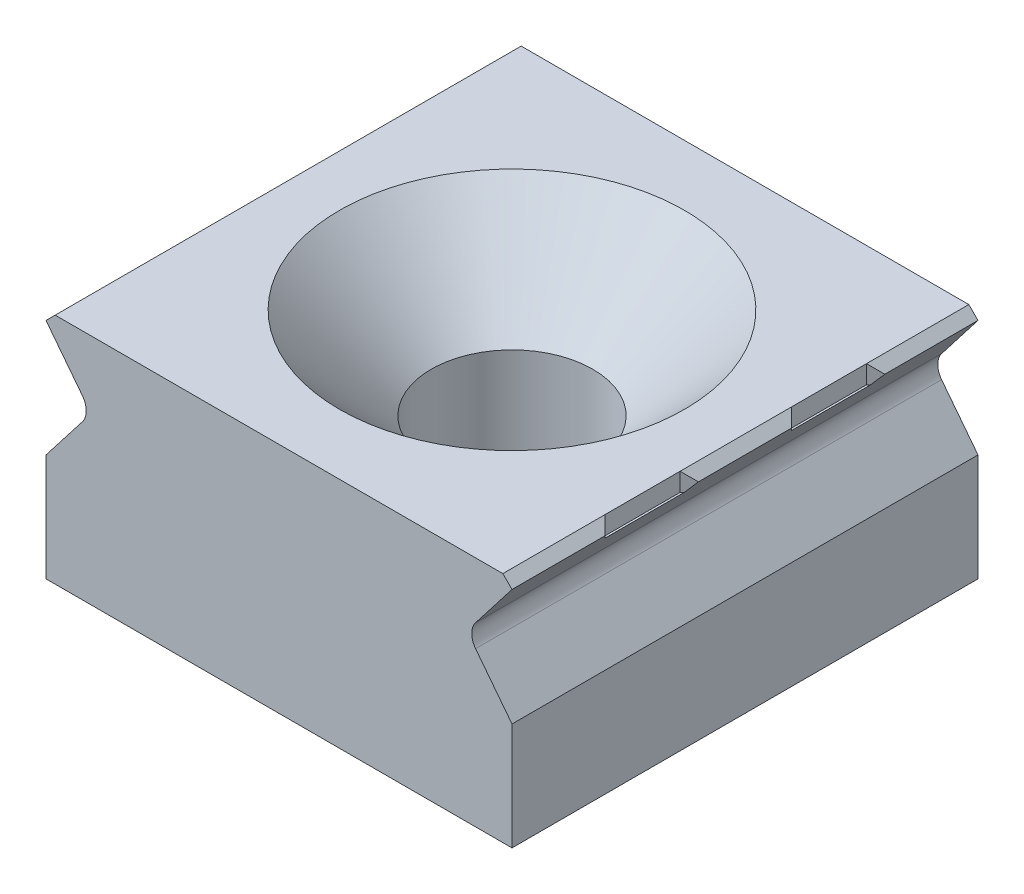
ISO-10303-21;
HEADER;
FILE_DESCRIPTION(('STEP AP214'),'2;1');
FILE_NAME('part.step','',(''),(''),'','','');
FILE_SCHEMA(('AUTOMOTIVE_DESIGN { 1 0 10303 214 1 1 1 1 }'));
ENDSEC;
DATA;
#1=APPLICATION_CONTEXT('core data for automotive mechanical design processes');
#2=APPLICATION_PROTOCOL_DEFINITION('international standard','automotive_design',2000,#1);
#3=PRODUCT_CONTEXT('',#1,'mechanical');
#4=PRODUCT('Part','Part','',(#3));
#5=PRODUCT_RELATED_PRODUCT_CATEGORY('part','',(#4));
#6=PRODUCT_DEFINITION_FORMATION('','',#4);
#7=PRODUCT_DEFINITION_CONTEXT('part definition',#1,'design');
#8=PRODUCT_DEFINITION('design','',#6,#7);
#9=PRODUCT_DEFINITION_SHAPE('','',#8);
#10=(LENGTH_UNIT() NAMED_UNIT(*) SI_UNIT(.MILLI.,.METRE.));
#11=(NAMED_UNIT(*) PLANE_ANGLE_UNIT() SI_UNIT($,.RADIAN.));
#12=(NAMED_UNIT(*) SI_UNIT($,.STERADIAN.) SOLID_ANGLE_UNIT());
#13=UNCERTAINTY_MEASURE_WITH_UNIT(LENGTH_MEASURE(1.E-05),#10,'distance_accuracy_value','');
#14=(GEOMETRIC_REPRESENTATION_CONTEXT(3) GLOBAL_UNCERTAINTY_ASSIGNED_CONTEXT((#13)) GLOBAL_UNIT_ASSIGNED_CONTEXT((#10,
#11,#12)) REPRESENTATION_CONTEXT('',''));
#15=CARTESIAN_POINT('',(0.,0.,0.));
#16=DIRECTION('',(0.,0.,1.));
#17=DIRECTION('',(1.,0.,0.));
#18=AXIS2_PLACEMENT_3D('',#15,#16,#17);
#19=CARTESIAN_POINT('',(12.2,6.35,0.));
#20=DIRECTION('',(0.707106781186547,0.707106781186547,0.));
#21=DIRECTION('',(0.,0.,1.));
#22=AXIS2_PLACEMENT_3D('',#19,#20,#21);
#23=PLANE('',#22);
#24=DIRECTION('',(0.577350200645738,-0.577350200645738,0.577350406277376));
#25=VECTOR('',#24,1.);
#26=CARTESIAN_POINT('',(13.2133335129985,5.33666648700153,-2.02666630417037));
#27=LINE('',#26,#25);
#28=CARTESIAN_POINT('',(12.2,6.35,-3.04000017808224));
#29=VERTEX_POINT('',#28);
#30=CARTESIAN_POINT('',(12.7,5.85,-2.54));
#31=VERTEX_POINT('',#30);
#32=EDGE_CURVE('E283',#29,#31,#27,.T.);
#33=ORIENTED_EDGE('',*,*,#32,.F.);
#34=DIRECTION('',(0.,0.,-1.));
#35=VECTOR('',#34,1.);
#36=CARTESIAN_POINT('',(12.2,6.35,-12.7));
#37=LINE('',#36,#35);
#38=CARTESIAN_POINT('',(12.2,6.35,3.03999982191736));
#39=VERTEX_POINT('',#38);
#40=EDGE_CURVE('E455',#39,#29,#37,.T.);
#41=ORIENTED_EDGE('',*,*,#40,.F.);
#42=DIRECTION('',(-0.577350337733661,0.577350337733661,0.577350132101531));
#43=VECTOR('',#42,1.);
#44=CARTESIAN_POINT('',(13.2133331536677,5.33666684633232,2.02666702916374));
#45=LINE('',#44,#43);
#46=CARTESIAN_POINT('',(12.7,5.85,2.53999999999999));
#47=VERTEX_POINT('',#46);
#48=EDGE_CURVE('E312',#47,#39,#45,.T.);
#49=ORIENTED_EDGE('',*,*,#48,.F.);
#50=DIRECTION('',(0.,0.,1.));
#51=VECTOR('',#50,1.);
#52=CARTESIAN_POINT('',(12.7,5.85,12.7));
#53=LINE('',#52,#51);
#54=EDGE_CURVE('E468',#31,#47,#53,.T.);
#55=ORIENTED_EDGE('',*,*,#54,.F.);
#56=EDGE_LOOP('',(#33,#41,#49,#55));
#57=FACE_BOUND('',#56,.T.);
#58=ADVANCED_FACE('F38',(#57),#23,.T.);
#59=CARTESIAN_POINT('',(-12.2,6.35,0.));
#60=DIRECTION('',(-0.707106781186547,0.707106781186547,0.));
#61=DIRECTION('',(0.,0.,-1.));
#62=AXIS2_PLACEMENT_3D('',#59,#60,#61);
#63=PLANE('',#62);
#64=DIRECTION('',(0.577350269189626,0.577350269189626,-0.577350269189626));
#65=VECTOR('',#64,1.);
#66=CARTESIAN_POINT('',(-13.2133333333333,5.33666666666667,-2.02666666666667));
#67=LINE('',#66,#65);
#68=CARTESIAN_POINT('',(-12.7,5.84999999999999,-2.53999999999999));
#69=VERTEX_POINT('',#68);
#70=CARTESIAN_POINT('',(-12.2,6.35,-3.04));
#71=VERTEX_POINT('',#70);
#72=EDGE_CURVE('E240',#69,#71,#67,.T.);
#73=ORIENTED_EDGE('',*,*,#72,.F.);
#74=DIRECTION('',(0.,0.,-1.));
#75=VECTOR('',#74,1.);
#76=CARTESIAN_POINT('',(-12.7,5.85,-12.7));
#77=LINE('',#76,#75);
#78=CARTESIAN_POINT('',(-12.7,5.84999999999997,2.54000000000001));
#79=VERTEX_POINT('',#78);
#80=EDGE_CURVE('E481',#79,#69,#77,.T.);
#81=ORIENTED_EDGE('',*,*,#80,.F.);
#82=DIRECTION('',(-0.577350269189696,-0.577350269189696,-0.577350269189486));
#83=VECTOR('',#82,1.);
#84=CARTESIAN_POINT('',(-13.2133333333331,5.33666666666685,2.02666666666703));
#85=LINE('',#84,#83);
#86=CARTESIAN_POINT('',(-12.2,6.35,3.03999999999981));
#87=VERTEX_POINT('',#86);
#88=EDGE_CURVE('E340',#87,#79,#85,.T.);
#89=ORIENTED_EDGE('',*,*,#88,.F.);
#90=DIRECTION('',(0.,0.,1.));
#91=VECTOR('',#90,1.);
#92=CARTESIAN_POINT('',(-12.2,6.35,12.7));
#93=LINE('',#92,#91);
#94=EDGE_CURVE('E449',#71,#87,#93,.T.);
#95=ORIENTED_EDGE('',*,*,#94,.F.);
#96=EDGE_LOOP('',(#73,#81,#89,#95));
#97=FACE_BOUND('',#96,.T.);
#98=ADVANCED_FACE('F537',(#97),#63,.T.);
#99=DIRECTION('',(0.577350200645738,-0.577350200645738,0.577350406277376));
#100=VECTOR('',#99,1.);
#101=CARTESIAN_POINT('',(9.8266664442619,8.72333355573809,4.74666542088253));
#102=LINE('',#101,#100);
#103=CARTESIAN_POINT('',(12.2,6.35,7.11999982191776));
#104=VERTEX_POINT('',#103);
#105=CARTESIAN_POINT('',(12.7,5.85,7.62000000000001));
#106=VERTEX_POINT('',#105);
#107=EDGE_CURVE('E337',#104,#106,#102,.T.);
#108=ORIENTED_EDGE('',*,*,#107,.F.);
#109=CARTESIAN_POINT('',(12.2,6.35,12.7));
#110=VERTEX_POINT('',#109);
#111=EDGE_CURVE('E450',#110,#104,#37,.T.);
#112=ORIENTED_EDGE('',*,*,#111,.F.);
#113=DIRECTION('',(-0.707106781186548,0.707106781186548,0.));
#114=VECTOR('',#113,1.);
#115=CARTESIAN_POINT('',(12.2,6.35,12.7));
#116=LINE('',#115,#114);
#117=CARTESIAN_POINT('',(12.7,5.85,12.7));
#118=VERTEX_POINT('',#117);
#119=EDGE_CURVE('E472',#118,#110,#116,.T.);
#120=ORIENTED_EDGE('',*,*,#119,.F.);
#121=EDGE_CURVE('E462',#106,#118,#53,.T.);
#122=ORIENTED_EDGE('',*,*,#121,.F.);
#123=EDGE_LOOP('',(#108,#112,#120,#122));
#124=FACE_BOUND('',#123,.T.);
#125=ADVANCED_FACE('F540',(#124),#23,.T.);
#126=DIRECTION('',(0.577350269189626,0.577350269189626,-0.577350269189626));
#127=VECTOR('',#126,1.);
#128=CARTESIAN_POINT('',(-9.82666666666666,8.72333333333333,4.74666666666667));
#129=LINE('',#128,#127);
#130=CARTESIAN_POINT('',(-12.7,5.84999999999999,7.62000000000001));
#131=VERTEX_POINT('',#130);
#132=CARTESIAN_POINT('',(-12.2,6.35,7.12));
#133=VERTEX_POINT('',#132);
#134=EDGE_CURVE('E343',#131,#133,#129,.T.);
#135=ORIENTED_EDGE('',*,*,#134,.F.);
#136=CARTESIAN_POINT('',(-12.7,5.85,12.7));
#137=VERTEX_POINT('',#136);
#138=EDGE_CURVE('E476',#137,#131,#77,.T.);
#139=ORIENTED_EDGE('',*,*,#138,.F.);
#140=DIRECTION('',(-0.707106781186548,-0.707106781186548,0.));
#141=VECTOR('',#140,1.);
#142=CARTESIAN_POINT('',(-12.2,6.35,12.7));
#143=LINE('',#142,#141);
#144=CARTESIAN_POINT('',(-12.2,6.35,12.7));
#145=VERTEX_POINT('',#144);
#146=EDGE_CURVE('E467',#145,#137,#143,.T.);
#147=ORIENTED_EDGE('',*,*,#146,.F.);
#148=EDGE_CURVE('E443',#133,#145,#93,.T.);
#149=ORIENTED_EDGE('',*,*,#148,.F.);
#150=EDGE_LOOP('',(#135,#139,#147,#149));
#151=FACE_BOUND('',#150,.T.);
#152=ADVANCED_FACE('F546',(#151),#63,.T.);
#153=CARTESIAN_POINT('',(12.7,6.35,12.7));
#154=DIRECTION('',(0.,0.,-1.));
#155=DIRECTION('',(-1.,0.,0.));
#156=AXIS2_PLACEMENT_3D('',#153,#154,#155);
#157=PLANE('',#156);
#158=DIRECTION('',(-0.612474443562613,0.790490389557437,0.));
#159=VECTOR('',#158,1.);
#160=CARTESIAN_POINT('',(10.7145471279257,2.06252555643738,12.7));
#161=LINE('',#160,#159);
#162=CARTESIAN_POINT('',(12.7,-0.500000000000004,12.7));
#163=VERTEX_POINT('',#162);
#164=CARTESIAN_POINT('',(10.7145471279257,2.06252555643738,12.7));
#165=VERTEX_POINT('',#164);
#166=EDGE_CURVE('E363',#163,#165,#161,.T.);
#167=ORIENTED_EDGE('',*,*,#166,.T.);
#168=CARTESIAN_POINT('',(11.5050375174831,2.675,12.7));
#169=DIRECTION('',(0.,0.,-1.));
#170=DIRECTION('',(1.,0.,0.));
#171=AXIS2_PLACEMENT_3D('',#168,#169,#170);
#172=CIRCLE('',#171,0.999999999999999);
#173=CARTESIAN_POINT('',(10.7145471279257,3.28747444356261,12.7));
#174=VERTEX_POINT('',#173);
#175=EDGE_CURVE('E359',#165,#174,#172,.T.);
#176=ORIENTED_EDGE('',*,*,#175,.T.);
#177=DIRECTION('',(0.612474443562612,0.790490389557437,0.));
#178=VECTOR('',#177,1.);
#179=CARTESIAN_POINT('',(12.7,5.85,12.7));
#180=LINE('',#179,#178);
#181=EDGE_CURVE('E345',#174,#118,#180,.T.);
#182=ORIENTED_EDGE('',*,*,#181,.T.);
#183=ORIENTED_EDGE('',*,*,#119,.T.);
#184=DIRECTION('',(1.,0.,0.));
#185=VECTOR('',#184,1.);
#186=CARTESIAN_POINT('',(12.7,6.35,12.7));
#187=LINE('',#186,#185);
#188=EDGE_CURVE('E408',#145,#110,#187,.T.);
#189=ORIENTED_EDGE('',*,*,#188,.F.);
#190=ORIENTED_EDGE('',*,*,#146,.T.);
#191=DIRECTION('',(-0.612474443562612,0.790490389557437,0.));
#192=VECTOR('',#191,1.);
#193=CARTESIAN_POINT('',(-12.7,5.85,12.7));
#194=LINE('',#193,#192);
#195=CARTESIAN_POINT('',(-10.7145471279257,3.28747444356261,12.7));
#196=VERTEX_POINT('',#195);
#197=EDGE_CURVE('E355',#196,#137,#194,.T.);
#198=ORIENTED_EDGE('',*,*,#197,.F.);
#199=CARTESIAN_POINT('',(-11.5050375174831,2.675,12.7));
#200=DIRECTION('',(0.,0.,1.));
#201=DIRECTION('',(-1.,0.,0.));
#202=AXIS2_PLACEMENT_3D('',#199,#200,#201);
#203=CIRCLE('',#202,0.999999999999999);
#204=CARTESIAN_POINT('',(-10.7145471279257,2.06252555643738,12.7));
#205=VERTEX_POINT('',#204);
#206=EDGE_CURVE('E396',#205,#196,#203,.T.);
#207=ORIENTED_EDGE('',*,*,#206,.F.);
#208=DIRECTION('',(0.612474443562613,0.790490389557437,0.));
#209=VECTOR('',#208,1.);
#210=CARTESIAN_POINT('',(-10.7145471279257,2.06252555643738,12.7));
#211=LINE('',#210,#209);
#212=CARTESIAN_POINT('',(-12.7,-0.500000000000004,12.7));
#213=VERTEX_POINT('',#212);
#214=EDGE_CURVE('E392',#213,#205,#211,.T.);
#215=ORIENTED_EDGE('',*,*,#214,.F.);
#216=DIRECTION('',(0.,-1.,0.));
#217=VECTOR('',#216,1.);
#218=CARTESIAN_POINT('',(-12.7,6.35,12.7));
#219=LINE('',#218,#217);
#220=CARTESIAN_POINT('',(-12.7,-6.35,12.7));
#221=VERTEX_POINT('',#220);
#222=EDGE_CURVE('E440',#213,#221,#219,.T.);
#223=ORIENTED_EDGE('',*,*,#222,.T.);
#224=DIRECTION('',(1.,0.,0.));
#225=VECTOR('',#224,1.);
#226=CARTESIAN_POINT('',(12.7,-6.35,12.7));
#227=LINE('',#226,#225);
#228=CARTESIAN_POINT('',(12.7,-6.35,12.7));
#229=VERTEX_POINT('',#228);
#230=EDGE_CURVE('E421',#221,#229,#227,.T.);
#231=ORIENTED_EDGE('',*,*,#230,.T.);
#232=DIRECTION('',(0.,-1.,0.));
#233=VECTOR('',#232,1.);
#234=CARTESIAN_POINT('',(12.7,6.35,12.7));
#235=LINE('',#234,#233);
#236=EDGE_CURVE('E437',#163,#229,#235,.T.);
#237=ORIENTED_EDGE('',*,*,#236,.F.);
#238=EDGE_LOOP('',(#167,#176,#182,#183,#189,#190,#198,#207,#215,#223,#231,#237));
#239=FACE_BOUND('',#238,.T.);
#240=ADVANCED_FACE('F605',(#239),#157,.F.);
#241=CARTESIAN_POINT('',(12.7,6.35,12.7));
#242=DIRECTION('',(-1.,0.,0.));
#243=DIRECTION('',(0.,0.,1.));
#244=AXIS2_PLACEMENT_3D('',#241,#242,#243);
#245=PLANE('',#244);
#246=DIRECTION('',(0.,0.,1.));
#247=VECTOR('',#246,1.);
#248=CARTESIAN_POINT('',(12.7,-0.500000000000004,-19.4186576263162));
#249=LINE('',#248,#247);
#250=CARTESIAN_POINT('',(12.7,-0.500000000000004,-12.7));
#251=VERTEX_POINT('',#250);
#252=EDGE_CURVE('E368',#251,#163,#249,.T.);
#253=ORIENTED_EDGE('',*,*,#252,.T.);
#254=ORIENTED_EDGE('',*,*,#236,.T.);
#255=DIRECTION('',(0.,0.,-1.));
#256=VECTOR('',#255,1.);
#257=CARTESIAN_POINT('',(12.7,-6.35,12.7));
#258=LINE('',#257,#256);
#259=CARTESIAN_POINT('',(12.7,-6.35,-12.7));
#260=VERTEX_POINT('',#259);
#261=EDGE_CURVE('E425',#229,#260,#258,.T.);
#262=ORIENTED_EDGE('',*,*,#261,.T.);
#263=DIRECTION('',(0.,-1.,0.));
#264=VECTOR('',#263,1.);
#265=CARTESIAN_POINT('',(12.7,6.35,-12.7));
#266=LINE('',#265,#264);
#267=EDGE_CURVE('E434',#251,#260,#266,.T.);
#268=ORIENTED_EDGE('',*,*,#267,.F.);
#269=EDGE_LOOP('',(#253,#254,#262,#268));
#270=FACE_BOUND('',#269,.T.);
#271=ADVANCED_FACE('F670',(#270),#245,.F.);
#272=CARTESIAN_POINT('',(12.7,6.35,-12.7));
#273=DIRECTION('',(0.,0.,1.));
#274=DIRECTION('',(1.,0.,0.));
#275=AXIS2_PLACEMENT_3D('',#272,#273,#274);
#276=PLANE('',#275);
#277=DIRECTION('',(0.612474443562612,-0.790490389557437,0.));
#278=VECTOR('',#277,1.);
#279=CARTESIAN_POINT('',(10.7145471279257,2.06252555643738,-12.7));
#280=LINE('',#279,#278);
#281=CARTESIAN_POINT('',(10.7145471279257,2.06252555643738,-12.7));
#282=VERTEX_POINT('',#281);
#283=EDGE_CURVE('E346',#282,#251,#280,.T.);
#284=ORIENTED_EDGE('',*,*,#283,.T.);
#285=ORIENTED_EDGE('',*,*,#267,.T.);
#286=DIRECTION('',(-1.,0.,0.));
#287=VECTOR('',#286,1.);
#288=CARTESIAN_POINT('',(12.7,-6.35,-12.7));
#289=LINE('',#288,#287);
#290=CARTESIAN_POINT('',(-12.7,-6.35,-12.7));
#291=VERTEX_POINT('',#290);
#292=EDGE_CURVE('E413',#260,#291,#289,.T.);
#293=ORIENTED_EDGE('',*,*,#292,.T.);
#294=DIRECTION('',(0.,-1.,0.));
#295=VECTOR('',#294,1.);
#296=CARTESIAN_POINT('',(-12.7,6.35,-12.7));
#297=LINE('',#296,#295);
#298=CARTESIAN_POINT('',(-12.7,-0.500000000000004,-12.7));
#299=VERTEX_POINT('',#298);
#300=EDGE_CURVE('E417',#299,#291,#297,.T.);
#301=ORIENTED_EDGE('',*,*,#300,.F.);
#302=DIRECTION('',(-0.612474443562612,-0.790490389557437,0.));
#303=VECTOR('',#302,1.);
#304=CARTESIAN_POINT('',(-10.7145471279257,2.06252555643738,-12.7));
#305=LINE('',#304,#303);
#306=CARTESIAN_POINT('',(-10.7145471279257,2.06252555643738,-12.7));
#307=VERTEX_POINT('',#306);
#308=EDGE_CURVE('E379',#307,#299,#305,.T.);
#309=ORIENTED_EDGE('',*,*,#308,.F.);
#310=CARTESIAN_POINT('',(-11.5050375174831,2.675,-12.7));
#311=DIRECTION('',(0.,0.,1.));
#312=DIRECTION('',(1.,0.,0.));
#313=AXIS2_PLACEMENT_3D('',#310,#311,#312);
#314=CIRCLE('',#313,0.999999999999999);
#315=CARTESIAN_POINT('',(-10.7145471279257,3.28747444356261,-12.7));
#316=VERTEX_POINT('',#315);
#317=EDGE_CURVE('E382',#316,#307,#314,.F.);
#318=ORIENTED_EDGE('',*,*,#317,.F.);
#319=DIRECTION('',(0.612474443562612,-0.790490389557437,0.));
#320=VECTOR('',#319,1.);
#321=CARTESIAN_POINT('',(-12.7,5.85,-12.7));
#322=LINE('',#321,#320);
#323=CARTESIAN_POINT('',(-12.7,5.85,-12.7));
#324=VERTEX_POINT('',#323);
#325=EDGE_CURVE('E386',#324,#316,#322,.T.);
#326=ORIENTED_EDGE('',*,*,#325,.F.);
#327=DIRECTION('',(0.707106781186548,0.707106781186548,0.));
#328=VECTOR('',#327,1.);
#329=CARTESIAN_POINT('',(-12.2,6.35,-12.7));
#330=LINE('',#329,#328);
#331=CARTESIAN_POINT('',(-12.2,6.35,-12.7));
#332=VERTEX_POINT('',#331);
#333=EDGE_CURVE('E454',#324,#332,#330,.T.);
#334=ORIENTED_EDGE('',*,*,#333,.T.);
#335=DIRECTION('',(-1.,0.,0.));
#336=VECTOR('',#335,1.);
#337=CARTESIAN_POINT('',(12.7,6.35,-12.7));
#338=LINE('',#337,#336);
#339=CARTESIAN_POINT('',(12.2,6.35,-12.7));
#340=VERTEX_POINT('',#339);
#341=EDGE_CURVE('E412',#340,#332,#338,.T.);
#342=ORIENTED_EDGE('',*,*,#341,.F.);
#343=DIRECTION('',(0.707106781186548,-0.707106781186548,0.));
#344=VECTOR('',#343,1.);
#345=CARTESIAN_POINT('',(12.2,6.35,-12.7));
#346=LINE('',#345,#344);
#347=CARTESIAN_POINT('',(12.7,5.85,-12.7));
#348=VERTEX_POINT('',#347);
#349=EDGE_CURVE('E458',#340,#348,#346,.T.);
#350=ORIENTED_EDGE('',*,*,#349,.T.);
#351=DIRECTION('',(-0.612474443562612,-0.790490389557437,0.));
#352=VECTOR('',#351,1.);
#353=CARTESIAN_POINT('',(12.7,5.85,-12.7));
#354=LINE('',#353,#352);
#355=CARTESIAN_POINT('',(10.7145471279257,3.28747444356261,-12.7));
#356=VERTEX_POINT('',#355);
#357=EDGE_CURVE('E350',#348,#356,#354,.T.);
#358=ORIENTED_EDGE('',*,*,#357,.T.);
#359=CARTESIAN_POINT('',(11.5050375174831,2.675,-12.7));
#360=DIRECTION('',(0.,0.,1.));
#361=DIRECTION('',(1.,0.,0.));
#362=AXIS2_PLACEMENT_3D('',#359,#360,#361);
#363=CIRCLE('',#362,0.999999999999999);
#364=EDGE_CURVE('E351',#356,#282,#363,.T.);
#365=ORIENTED_EDGE('',*,*,#364,.T.);
#366=EDGE_LOOP('',(#284,#285,#293,#301,#309,#318,#326,#334,#342,#350,#358,#365));
#367=FACE_BOUND('',#366,.T.);
#368=ADVANCED_FACE('F579',(#367),#276,.F.);
#369=CARTESIAN_POINT('',(-12.7,6.35,12.7));
#370=DIRECTION('',(1.,0.,0.));
#371=DIRECTION('',(0.,0.,-1.));
#372=AXIS2_PLACEMENT_3D('',#369,#370,#371);
#373=PLANE('',#372);
#374=ORIENTED_EDGE('',*,*,#222,.F.);
#375=DIRECTION('',(0.,0.,1.));
#376=VECTOR('',#375,1.);
#377=CARTESIAN_POINT('',(-12.7,-0.500000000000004,-19.4186576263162));
#378=LINE('',#377,#376);
#379=EDGE_CURVE('E400',#299,#213,#378,.T.);
#380=ORIENTED_EDGE('',*,*,#379,.F.);
#381=ORIENTED_EDGE('',*,*,#300,.T.);
#382=DIRECTION('',(0.,0.,1.));
#383=VECTOR('',#382,1.);
#384=CARTESIAN_POINT('',(-12.7,-6.35,12.7));
#385=LINE('',#384,#383);
#386=EDGE_CURVE('E389',#291,#221,#385,.T.);
#387=ORIENTED_EDGE('',*,*,#386,.T.);
#388=EDGE_LOOP('',(#374,#380,#381,#387));
#389=FACE_BOUND('',#388,.T.);
#390=ADVANCED_FACE('F665',(#389),#373,.F.);
#391=CARTESIAN_POINT('',(0.,6.35,0.));
#392=DIRECTION('',(0.,1.,0.));
#393=DIRECTION('',(0.,0.,1.));
#394=AXIS2_PLACEMENT_3D('',#391,#392,#393);
#395=PLANE('',#394);
#396=CARTESIAN_POINT('',(0.,6.35,0.));
#397=DIRECTION('',(0.,1.,0.));
#398=DIRECTION('',(0.,0.,1.));
#399=AXIS2_PLACEMENT_3D('',#396,#397,#398);
#400=CIRCLE('',#399,9.40000000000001);
#401=CARTESIAN_POINT('',(0.,6.35,9.40000000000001));
#402=VERTEX_POINT('',#401);
#403=EDGE_CURVE('E11',#402,#402,#400,.F.);
#404=ORIENTED_EDGE('',*,*,#403,.T.);
#405=EDGE_LOOP('',(#404));
#406=FACE_BOUND('',#405,.T.);
#407=ORIENTED_EDGE('',*,*,#188,.T.);
#408=ORIENTED_EDGE('',*,*,#111,.T.);
#409=DIRECTION('',(0.,0.,1.));
#410=VECTOR('',#409,1.);
#411=CARTESIAN_POINT('',(12.2,6.35,7.11999982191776));
#412=LINE('',#411,#410);
#413=EDGE_CURVE('E291',#39,#104,#412,.T.);
#414=ORIENTED_EDGE('',*,*,#413,.F.);
#415=ORIENTED_EDGE('',*,*,#40,.T.);
#416=DIRECTION('',(0.,0.,1.));
#417=VECTOR('',#416,1.);
#418=CARTESIAN_POINT('',(12.2,6.35,-3.04000017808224));
#419=LINE('',#418,#417);
#420=CARTESIAN_POINT('',(12.2,6.35,-7.12000017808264));
#421=VERTEX_POINT('',#420);
#422=EDGE_CURVE('E266',#421,#29,#419,.T.);
#423=ORIENTED_EDGE('',*,*,#422,.F.);
#424=EDGE_CURVE('E448',#421,#340,#37,.T.);
#425=ORIENTED_EDGE('',*,*,#424,.T.);
#426=ORIENTED_EDGE('',*,*,#341,.T.);
#427=CARTESIAN_POINT('',(-12.2,6.35,-7.12000000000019));
#428=VERTEX_POINT('',#427);
#429=EDGE_CURVE('E444',#332,#428,#93,.T.);
#430=ORIENTED_EDGE('',*,*,#429,.T.);
#431=DIRECTION('',(0.,0.,-1.));
#432=VECTOR('',#431,1.);
#433=CARTESIAN_POINT('',(-12.2,6.35,-7.12000000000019));
#434=LINE('',#433,#432);
#435=EDGE_CURVE('E234',#71,#428,#434,.T.);
#436=ORIENTED_EDGE('',*,*,#435,.F.);
#437=ORIENTED_EDGE('',*,*,#94,.T.);
#438=DIRECTION('',(0.,0.,-1.));
#439=VECTOR('',#438,1.);
#440=CARTESIAN_POINT('',(-12.2,6.35,3.03999999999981));
#441=LINE('',#440,#439);
#442=EDGE_CURVE('E296',#133,#87,#441,.T.);
#443=ORIENTED_EDGE('',*,*,#442,.F.);
#444=ORIENTED_EDGE('',*,*,#148,.T.);
#445=EDGE_LOOP('',(#407,#408,#414,#415,#423,#425,#426,#430,#436,#437,#443,#444));
#446=FACE_BOUND('',#445,.T.);
#447=ADVANCED_FACE('F561',(#406,#446),#395,.T.);
#448=CARTESIAN_POINT('',(0.,-6.35,0.));
#449=DIRECTION('',(0.,1.,0.));
#450=DIRECTION('',(0.,0.,1.));
#451=AXIS2_PLACEMENT_3D('',#448,#449,#450);
#452=PLANE('',#451);
#453=CARTESIAN_POINT('',(0.,-6.35,0.));
#454=DIRECTION('',(0.,1.,0.));
#455=DIRECTION('',(0.,0.,1.));
#456=AXIS2_PLACEMENT_3D('',#453,#454,#455);
#457=CIRCLE('',#456,4.4);
#458=CARTESIAN_POINT('',(0.,-6.35,4.4));
#459=VERTEX_POINT('',#458);
#460=EDGE_CURVE('E275',#459,#459,#457,.F.);
#461=ORIENTED_EDGE('',*,*,#460,.F.);
#462=EDGE_LOOP('',(#461));
#463=FACE_BOUND('',#462,.T.);
#464=ORIENTED_EDGE('',*,*,#386,.F.);
#465=ORIENTED_EDGE('',*,*,#292,.F.);
#466=ORIENTED_EDGE('',*,*,#261,.F.);
#467=ORIENTED_EDGE('',*,*,#230,.F.);
#468=EDGE_LOOP('',(#464,#465,#466,#467));
#469=FACE_BOUND('',#468,.T.);
#470=ADVANCED_FACE('F553',(#463,#469),#452,.F.);
#471=DIRECTION('',(-0.577350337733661,0.577350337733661,0.577350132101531));
#472=VECTOR('',#471,1.);
#473=CARTESIAN_POINT('',(9.82666688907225,8.72333311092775,-4.74666791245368));
#474=LINE('',#473,#472);
#475=CARTESIAN_POINT('',(12.7,5.85,-7.62000000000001));
#476=VERTEX_POINT('',#475);
#477=EDGE_CURVE('E260',#476,#421,#474,.T.);
#478=ORIENTED_EDGE('',*,*,#477,.F.);
#479=EDGE_CURVE('E463',#348,#476,#53,.T.);
#480=ORIENTED_EDGE('',*,*,#479,.F.);
#481=ORIENTED_EDGE('',*,*,#349,.F.);
#482=ORIENTED_EDGE('',*,*,#424,.F.);
#483=EDGE_LOOP('',(#478,#480,#481,#482));
#484=FACE_BOUND('',#483,.T.);
#485=ADVANCED_FACE('F541',(#484),#23,.T.);
#486=DIRECTION('',(-0.577350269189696,-0.577350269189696,-0.577350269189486));
#487=VECTOR('',#486,1.);
#488=CARTESIAN_POINT('',(-9.82666666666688,8.72333333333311,-4.74666666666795));
#489=LINE('',#488,#487);
#490=CARTESIAN_POINT('',(-12.7,5.84999999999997,-7.61999999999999));
#491=VERTEX_POINT('',#490);
#492=EDGE_CURVE('E286',#428,#491,#489,.T.);
#493=ORIENTED_EDGE('',*,*,#492,.F.);
#494=ORIENTED_EDGE('',*,*,#429,.F.);
#495=ORIENTED_EDGE('',*,*,#333,.F.);
#496=EDGE_CURVE('E475',#491,#324,#77,.T.);
#497=ORIENTED_EDGE('',*,*,#496,.F.);
#498=EDGE_LOOP('',(#493,#494,#495,#497));
#499=FACE_BOUND('',#498,.T.);
#500=ADVANCED_FACE('F547',(#499),#63,.T.);
#501=CARTESIAN_POINT('',(-12.7,5.85,-19.4186576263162));
#502=DIRECTION('',(0.790490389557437,0.612474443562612,0.));
#503=DIRECTION('',(-0.612474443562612,0.790490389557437,0.));
#504=AXIS2_PLACEMENT_3D('',#501,#502,#503);
#505=PLANE('',#504);
#506=ORIENTED_EDGE('',*,*,#80,.T.);
#507=DIRECTION('',(0.522296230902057,-0.67410184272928,-0.522296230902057));
#508=VECTOR('',#507,1.);
#509=CARTESIAN_POINT('',(-8.09561439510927,-0.0926521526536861,-7.14438560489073));
#510=LINE('',#509,#508);
#511=CARTESIAN_POINT('',(-12.3125984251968,5.35,-2.92740157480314));
#512=VERTEX_POINT('',#511);
#513=EDGE_CURVE('E520',#69,#512,#510,.T.);
#514=ORIENTED_EDGE('',*,*,#513,.T.);
#515=DIRECTION('',(0.,0.,1.));
#516=VECTOR('',#515,1.);
#517=CARTESIAN_POINT('',(-12.3125984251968,5.35,-19.4186576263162));
#518=LINE('',#517,#516);
#519=CARTESIAN_POINT('',(-12.3125984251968,5.35,-7.23259842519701));
#520=VERTEX_POINT('',#519);
#521=EDGE_CURVE('E230',#520,#512,#518,.T.);
#522=ORIENTED_EDGE('',*,*,#521,.F.);
#523=DIRECTION('',(-0.522296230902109,0.674101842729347,-0.522296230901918));
#524=VECTOR('',#523,1.);
#525=CARTESIAN_POINT('',(-15.9185953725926,10.0040814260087,-10.8385953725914));
#526=LINE('',#525,#524);
#527=EDGE_CURVE('E516',#520,#491,#526,.T.);
#528=ORIENTED_EDGE('',*,*,#527,.T.);
#529=ORIENTED_EDGE('',*,*,#496,.T.);
#530=ORIENTED_EDGE('',*,*,#325,.T.);
#531=DIRECTION('',(0.,0.,1.));
#532=VECTOR('',#531,1.);
#533=CARTESIAN_POINT('',(-10.7145471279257,3.28747444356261,-19.4186576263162));
#534=LINE('',#533,#532);
#535=EDGE_CURVE('E383',#316,#196,#534,.T.);
#536=ORIENTED_EDGE('',*,*,#535,.T.);
#537=ORIENTED_EDGE('',*,*,#197,.T.);
#538=ORIENTED_EDGE('',*,*,#138,.T.);
#539=DIRECTION('',(0.522296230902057,-0.67410184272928,-0.522296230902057));
#540=VECTOR('',#539,1.);
#541=CARTESIAN_POINT('',(-5.32403393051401,-3.66979360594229,0.244033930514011));
#542=LINE('',#541,#540);
#543=CARTESIAN_POINT('',(-12.3125984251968,5.35,7.23259842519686));
#544=VERTEX_POINT('',#543);
#545=EDGE_CURVE('E500',#131,#544,#542,.T.);
#546=ORIENTED_EDGE('',*,*,#545,.T.);
#547=DIRECTION('',(0.,0.,1.));
#548=VECTOR('',#547,1.);
#549=CARTESIAN_POINT('',(-12.3125984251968,5.35,-19.4186576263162));
#550=LINE('',#549,#548);
#551=CARTESIAN_POINT('',(-12.3125984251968,5.35,2.92740157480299));
#552=VERTEX_POINT('',#551);
#553=EDGE_CURVE('E493',#552,#544,#550,.T.);
#554=ORIENTED_EDGE('',*,*,#553,.F.);
#555=DIRECTION('',(-0.522296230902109,0.674101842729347,-0.522296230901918));
#556=VECTOR('',#555,1.);
#557=CARTESIAN_POINT('',(-18.6901758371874,13.5812228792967,-3.45017583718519));
#558=LINE('',#557,#556);
#559=EDGE_CURVE('E496',#552,#79,#558,.T.);
#560=ORIENTED_EDGE('',*,*,#559,.T.);
#561=EDGE_LOOP('',(#506,#514,#522,#528,#529,#530,#536,#537,#538,#546,#554,#560));
#562=FACE_BOUND('',#561,.T.);
#563=ADVANCED_FACE('F559',(#562),#505,.F.);
#564=CARTESIAN_POINT('',(-11.5050375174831,2.675,-19.4186576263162));
#565=DIRECTION('',(0.,0.,1.));
#566=DIRECTION('',(1.,0.,0.));
#567=AXIS2_PLACEMENT_3D('',#564,#565,#566);
#568=CYLINDRICAL_SURFACE('',#567,0.999999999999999);
#569=ORIENTED_EDGE('',*,*,#317,.T.);
#570=DIRECTION('',(0.,0.,1.));
#571=VECTOR('',#570,1.);
#572=CARTESIAN_POINT('',(-10.7145471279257,2.06252555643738,-19.4186576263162));
#573=LINE('',#572,#571);
#574=EDGE_CURVE('E403',#307,#205,#573,.T.);
#575=ORIENTED_EDGE('',*,*,#574,.T.);
#576=ORIENTED_EDGE('',*,*,#206,.T.);
#577=ORIENTED_EDGE('',*,*,#535,.F.);
#578=EDGE_LOOP('',(#569,#575,#576,#577));
#579=FACE_BOUND('',#578,.T.);
#580=ADVANCED_FACE('F655',(#579),#568,.F.);
#581=CARTESIAN_POINT('',(-10.7145471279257,2.06252555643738,-19.4186576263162));
#582=DIRECTION('',(0.790490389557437,-0.612474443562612,0.));
#583=DIRECTION('',(0.612474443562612,0.790490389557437,0.));
#584=AXIS2_PLACEMENT_3D('',#581,#582,#583);
#585=PLANE('',#584);
#586=ORIENTED_EDGE('',*,*,#308,.T.);
#587=ORIENTED_EDGE('',*,*,#379,.T.);
#588=ORIENTED_EDGE('',*,*,#214,.T.);
#589=ORIENTED_EDGE('',*,*,#574,.F.);
#590=EDGE_LOOP('',(#586,#587,#588,#589));
#591=FACE_BOUND('',#590,.T.);
#592=ADVANCED_FACE('F652',(#591),#585,.F.);
#593=CARTESIAN_POINT('',(11.5050375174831,2.675,-19.4186576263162));
#594=DIRECTION('',(0.,0.,1.));
#595=DIRECTION('',(1.,0.,0.));
#596=AXIS2_PLACEMENT_3D('',#593,#594,#595);
#597=CYLINDRICAL_SURFACE('',#596,0.999999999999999);
#598=DIRECTION('',(0.,0.,1.));
#599=VECTOR('',#598,1.);
#600=CARTESIAN_POINT('',(10.7145471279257,3.28747444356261,-19.4186576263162));
#601=LINE('',#600,#599);
#602=EDGE_CURVE('E367',#356,#174,#601,.T.);
#603=ORIENTED_EDGE('',*,*,#602,.T.);
#604=ORIENTED_EDGE('',*,*,#175,.F.);
#605=DIRECTION('',(0.,0.,1.));
#606=VECTOR('',#605,1.);
#607=CARTESIAN_POINT('',(10.7145471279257,2.06252555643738,-19.4186576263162));
#608=LINE('',#607,#606);
#609=EDGE_CURVE('E372',#282,#165,#608,.T.);
#610=ORIENTED_EDGE('',*,*,#609,.F.);
#611=ORIENTED_EDGE('',*,*,#364,.F.);
#612=EDGE_LOOP('',(#603,#604,#610,#611));
#613=FACE_BOUND('',#612,.T.);
#614=ADVANCED_FACE('F649',(#613),#597,.F.);
#615=CARTESIAN_POINT('',(10.7145471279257,2.06252555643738,-19.4186576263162));
#616=DIRECTION('',(0.790490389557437,0.612474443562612,0.));
#617=DIRECTION('',(-0.612474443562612,0.790490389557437,0.));
#618=AXIS2_PLACEMENT_3D('',#615,#616,#617);
#619=PLANE('',#618);
#620=ORIENTED_EDGE('',*,*,#609,.T.);
#621=ORIENTED_EDGE('',*,*,#166,.F.);
#622=ORIENTED_EDGE('',*,*,#252,.F.);
#623=ORIENTED_EDGE('',*,*,#283,.F.);
#624=EDGE_LOOP('',(#620,#621,#622,#623));
#625=FACE_BOUND('',#624,.T.);
#626=ADVANCED_FACE('F640',(#625),#619,.T.);
#627=CARTESIAN_POINT('',(12.7,5.85,-19.4186576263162));
#628=DIRECTION('',(0.790490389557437,-0.612474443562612,0.));
#629=DIRECTION('',(0.612474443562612,0.790490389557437,0.));
#630=AXIS2_PLACEMENT_3D('',#627,#628,#629);
#631=PLANE('',#630);
#632=DIRECTION('',(-0.522296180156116,-0.674101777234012,-0.522296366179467));
#633=VECTOR('',#632,1.);
#634=CARTESIAN_POINT('',(8.09561364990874,-0.0926531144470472,-7.14438799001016));
#635=LINE('',#634,#633);
#636=CARTESIAN_POINT('',(12.3125984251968,5.35,-2.92740171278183));
#637=VERTEX_POINT('',#636);
#638=EDGE_CURVE('E511',#31,#637,#635,.T.);
#639=ORIENTED_EDGE('',*,*,#638,.F.);
#640=ORIENTED_EDGE('',*,*,#54,.T.);
#641=DIRECTION('',(0.522296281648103,0.674101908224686,-0.522296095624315));
#642=VECTOR('',#641,1.);
#643=CARTESIAN_POINT('',(18.6901748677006,13.5812216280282,-3.45017273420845));
#644=LINE('',#643,#642);
#645=CARTESIAN_POINT('',(12.3125984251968,5.35,2.92740143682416));
#646=VERTEX_POINT('',#645);
#647=EDGE_CURVE('E485',#646,#47,#644,.T.);
#648=ORIENTED_EDGE('',*,*,#647,.F.);
#649=DIRECTION('',(0.,0.,1.));
#650=VECTOR('',#649,1.);
#651=CARTESIAN_POINT('',(12.3125984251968,5.35,-19.4186576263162));
#652=LINE('',#651,#650);
#653=CARTESIAN_POINT('',(12.3125984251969,5.35,7.23259828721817));
#654=VERTEX_POINT('',#653);
#655=EDGE_CURVE('E480',#646,#654,#652,.T.);
#656=ORIENTED_EDGE('',*,*,#655,.T.);
#657=DIRECTION('',(-0.522296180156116,-0.674101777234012,-0.522296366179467));
#658=VECTOR('',#657,1.);
#659=CARTESIAN_POINT('',(5.32403273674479,-3.66979514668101,0.2440301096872));
#660=LINE('',#659,#658);
#661=EDGE_CURVE('E489',#106,#654,#660,.T.);
#662=ORIENTED_EDGE('',*,*,#661,.F.);
#663=ORIENTED_EDGE('',*,*,#121,.T.);
#664=ORIENTED_EDGE('',*,*,#181,.F.);
#665=ORIENTED_EDGE('',*,*,#602,.F.);
#666=ORIENTED_EDGE('',*,*,#357,.F.);
#667=ORIENTED_EDGE('',*,*,#479,.T.);
#668=DIRECTION('',(0.522296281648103,0.674101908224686,-0.522296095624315));
#669=VECTOR('',#668,1.);
#670=CARTESIAN_POINT('',(15.9185948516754,10.0040807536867,-10.8385937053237));
#671=LINE('',#670,#669);
#672=CARTESIAN_POINT('',(12.3125984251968,5.35,-7.23259856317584));
#673=VERTEX_POINT('',#672);
#674=EDGE_CURVE('E508',#673,#476,#671,.T.);
#675=ORIENTED_EDGE('',*,*,#674,.F.);
#676=DIRECTION('',(0.,0.,1.));
#677=VECTOR('',#676,1.);
#678=CARTESIAN_POINT('',(12.3125984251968,5.35,-19.4186576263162));
#679=LINE('',#678,#677);
#680=EDGE_CURVE('E504',#673,#637,#679,.T.);
#681=ORIENTED_EDGE('',*,*,#680,.T.);
#682=EDGE_LOOP('',(#639,#640,#648,#656,#662,#663,#664,#665,#666,#667,#675,#681));
#683=FACE_BOUND('',#682,.T.);
#684=ADVANCED_FACE('F574',(#683),#631,.T.);
#685=CARTESIAN_POINT('',(12.7,5.35,7.62000000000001));
#686=DIRECTION('',(-0.707106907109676,0.,0.707106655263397));
#687=DIRECTION('',(0.707106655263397,0.,0.707106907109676));
#688=AXIS2_PLACEMENT_3D('',#685,#686,#687);
#689=PLANE('',#688);
#690=ORIENTED_EDGE('',*,*,#107,.T.);
#691=ORIENTED_EDGE('',*,*,#661,.T.);
#692=DIRECTION('',(0.707106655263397,0.,0.707106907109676));
#693=VECTOR('',#692,1.);
#694=CARTESIAN_POINT('',(12.7,5.35,7.62000000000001));
#695=LINE('',#694,#693);
#696=CARTESIAN_POINT('',(12.2,5.35,7.11999982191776));
#697=VERTEX_POINT('',#696);
#698=EDGE_CURVE('E323',#697,#654,#695,.T.);
#699=ORIENTED_EDGE('',*,*,#698,.F.);
#700=DIRECTION('',(0.,1.,0.));
#701=VECTOR('',#700,1.);
#702=CARTESIAN_POINT('',(12.2,5.35,7.11999982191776));
#703=LINE('',#702,#701);
#704=EDGE_CURVE('E307',#697,#104,#703,.T.);
#705=ORIENTED_EDGE('',*,*,#704,.T.);
#706=EDGE_LOOP('',(#690,#691,#699,#705));
#707=FACE_BOUND('',#706,.T.);
#708=ADVANCED_FACE('F632',(#707),#689,.F.);
#709=CARTESIAN_POINT('',(12.2,5.35,7.11999982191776));
#710=DIRECTION('',(-1.,0.,0.));
#711=DIRECTION('',(0.,0.,1.));
#712=AXIS2_PLACEMENT_3D('',#709,#710,#711);
#713=PLANE('',#712);
#714=ORIENTED_EDGE('',*,*,#413,.T.);
#715=ORIENTED_EDGE('',*,*,#704,.F.);
#716=DIRECTION('',(0.,0.,1.));
#717=VECTOR('',#716,1.);
#718=CARTESIAN_POINT('',(12.2,5.35,7.11999982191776));
#719=LINE('',#718,#717);
#720=CARTESIAN_POINT('',(12.2,5.35,3.03999982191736));
#721=VERTEX_POINT('',#720);
#722=EDGE_CURVE('E319',#721,#697,#719,.T.);
#723=ORIENTED_EDGE('',*,*,#722,.F.);
#724=DIRECTION('',(0.,1.,0.));
#725=VECTOR('',#724,1.);
#726=CARTESIAN_POINT('',(12.2,5.35,3.03999982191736));
#727=LINE('',#726,#725);
#728=EDGE_CURVE('E326',#721,#39,#727,.T.);
#729=ORIENTED_EDGE('',*,*,#728,.T.);
#730=EDGE_LOOP('',(#714,#715,#723,#729));
#731=FACE_BOUND('',#730,.T.);
#732=ADVANCED_FACE('F613',(#731),#713,.F.);
#733=CARTESIAN_POINT('',(12.2,5.35,3.03999982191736));
#734=DIRECTION('',(-0.707106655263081,0.,-0.707106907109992));
#735=DIRECTION('',(-0.707106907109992,0.,0.707106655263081));
#736=AXIS2_PLACEMENT_3D('',#733,#734,#735);
#737=PLANE('',#736);
#738=ORIENTED_EDGE('',*,*,#48,.T.);
#739=ORIENTED_EDGE('',*,*,#728,.F.);
#740=DIRECTION('',(-0.707106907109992,0.,0.707106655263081));
#741=VECTOR('',#740,1.);
#742=CARTESIAN_POINT('',(12.2,5.35,3.03999982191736));
#743=LINE('',#742,#741);
#744=EDGE_CURVE('E316',#646,#721,#743,.T.);
#745=ORIENTED_EDGE('',*,*,#744,.F.);
#746=ORIENTED_EDGE('',*,*,#647,.T.);
#747=EDGE_LOOP('',(#738,#739,#745,#746));
#748=FACE_BOUND('',#747,.T.);
#749=ADVANCED_FACE('F626',(#748),#737,.F.);
#750=CARTESIAN_POINT('',(0.,5.35,0.));
#751=DIRECTION('',(0.,1.,0.));
#752=DIRECTION('',(0.,0.,1.));
#753=AXIS2_PLACEMENT_3D('',#750,#751,#752);
#754=PLANE('',#753);
#755=ORIENTED_EDGE('',*,*,#744,.T.);
#756=ORIENTED_EDGE('',*,*,#722,.T.);
#757=ORIENTED_EDGE('',*,*,#698,.T.);
#758=ORIENTED_EDGE('',*,*,#655,.F.);
#759=EDGE_LOOP('',(#755,#756,#757,#758));
#760=FACE_BOUND('',#759,.T.);
#761=ADVANCED_FACE('F628',(#760),#754,.T.);
#762=CARTESIAN_POINT('',(-12.2,5.35,7.12));
#763=DIRECTION('',(0.707106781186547,0.,0.707106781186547));
#764=DIRECTION('',(0.707106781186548,0.,-0.707106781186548));
#765=AXIS2_PLACEMENT_3D('',#762,#763,#764);
#766=PLANE('',#765);
#767=ORIENTED_EDGE('',*,*,#134,.T.);
#768=DIRECTION('',(0.,1.,0.));
#769=VECTOR('',#768,1.);
#770=CARTESIAN_POINT('',(-12.2,5.35,7.12));
#771=LINE('',#770,#769);
#772=CARTESIAN_POINT('',(-12.2,5.35,7.12));
#773=VERTEX_POINT('',#772);
#774=EDGE_CURVE('E303',#773,#133,#771,.T.);
#775=ORIENTED_EDGE('',*,*,#774,.F.);
#776=DIRECTION('',(0.707106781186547,0.,-0.707106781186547));
#777=VECTOR('',#776,1.);
#778=CARTESIAN_POINT('',(-12.2,5.35,7.12));
#779=LINE('',#778,#777);
#780=EDGE_CURVE('E292',#544,#773,#779,.T.);
#781=ORIENTED_EDGE('',*,*,#780,.F.);
#782=ORIENTED_EDGE('',*,*,#545,.F.);
#783=EDGE_LOOP('',(#767,#775,#781,#782));
#784=FACE_BOUND('',#783,.T.);
#785=ADVANCED_FACE('F700',(#784),#766,.F.);
#786=CARTESIAN_POINT('',(-12.7,5.35,2.54));
#787=DIRECTION('',(0.707106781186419,0.,-0.707106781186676));
#788=DIRECTION('',(-0.707106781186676,0.,-0.707106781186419));
#789=AXIS2_PLACEMENT_3D('',#786,#787,#788);
#790=PLANE('',#789);
#791=ORIENTED_EDGE('',*,*,#88,.T.);
#792=ORIENTED_EDGE('',*,*,#559,.F.);
#793=DIRECTION('',(-0.707106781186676,0.,-0.707106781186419));
#794=VECTOR('',#793,1.);
#795=CARTESIAN_POINT('',(-12.7,5.35,2.54));
#796=LINE('',#795,#794);
#797=CARTESIAN_POINT('',(-12.2,5.35,3.03999999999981));
#798=VERTEX_POINT('',#797);
#799=EDGE_CURVE('E300',#798,#552,#796,.T.);
#800=ORIENTED_EDGE('',*,*,#799,.F.);
#801=DIRECTION('',(0.,1.,0.));
#802=VECTOR('',#801,1.);
#803=CARTESIAN_POINT('',(-12.2,5.35,3.03999999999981));
#804=LINE('',#803,#802);
#805=EDGE_CURVE('E308',#798,#87,#804,.T.);
#806=ORIENTED_EDGE('',*,*,#805,.T.);
#807=EDGE_LOOP('',(#791,#792,#800,#806));
#808=FACE_BOUND('',#807,.T.);
#809=ADVANCED_FACE('F708',(#808),#790,.F.);
#810=CARTESIAN_POINT('',(0.,5.35,0.));
#811=DIRECTION('',(0.,1.,0.));
#812=DIRECTION('',(0.,0.,1.));
#813=AXIS2_PLACEMENT_3D('',#810,#811,#812);
#814=PLANE('',#813);
#815=ORIENTED_EDGE('',*,*,#553,.T.);
#816=ORIENTED_EDGE('',*,*,#780,.T.);
#817=DIRECTION('',(0.,0.,-1.));
#818=VECTOR('',#817,1.);
#819=CARTESIAN_POINT('',(-12.2,5.35,3.03999999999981));
#820=LINE('',#819,#818);
#821=EDGE_CURVE('E295',#773,#798,#820,.T.);
#822=ORIENTED_EDGE('',*,*,#821,.T.);
#823=ORIENTED_EDGE('',*,*,#799,.T.);
#824=EDGE_LOOP('',(#815,#816,#822,#823));
#825=FACE_BOUND('',#824,.T.);
#826=ADVANCED_FACE('F704',(#825),#814,.T.);
#827=CARTESIAN_POINT('',(-12.2,5.35,3.03999999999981));
#828=DIRECTION('',(1.,0.,0.));
#829=DIRECTION('',(0.,0.,-1.));
#830=AXIS2_PLACEMENT_3D('',#827,#828,#829);
#831=PLANE('',#830);
#832=ORIENTED_EDGE('',*,*,#442,.T.);
#833=ORIENTED_EDGE('',*,*,#805,.F.);
#834=ORIENTED_EDGE('',*,*,#821,.F.);
#835=ORIENTED_EDGE('',*,*,#774,.T.);
#836=EDGE_LOOP('',(#832,#833,#834,#835));
#837=FACE_BOUND('',#836,.T.);
#838=ADVANCED_FACE('F710',(#837),#831,.F.);
#839=CARTESIAN_POINT('',(12.7,5.35,-2.53999999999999));
#840=DIRECTION('',(-0.707106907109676,0.,0.707106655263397));
#841=DIRECTION('',(0.707106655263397,0.,0.707106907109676));
#842=AXIS2_PLACEMENT_3D('',#839,#840,#841);
#843=PLANE('',#842);
#844=ORIENTED_EDGE('',*,*,#32,.T.);
#845=ORIENTED_EDGE('',*,*,#638,.T.);
#846=DIRECTION('',(0.707106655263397,0.,0.707106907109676));
#847=VECTOR('',#846,1.);
#848=CARTESIAN_POINT('',(12.7,5.35,-2.53999999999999));
#849=LINE('',#848,#847);
#850=CARTESIAN_POINT('',(12.2,5.35,-3.04000017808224));
#851=VERTEX_POINT('',#850);
#852=EDGE_CURVE('E62',#851,#637,#849,.T.);
#853=ORIENTED_EDGE('',*,*,#852,.F.);
#854=DIRECTION('',(0.,1.,0.));
#855=VECTOR('',#854,1.);
#856=CARTESIAN_POINT('',(12.2,5.35,-3.04000017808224));
#857=LINE('',#856,#855);
#858=EDGE_CURVE('E258',#851,#29,#857,.T.);
#859=ORIENTED_EDGE('',*,*,#858,.T.);
#860=EDGE_LOOP('',(#844,#845,#853,#859));
#861=FACE_BOUND('',#860,.T.);
#862=ADVANCED_FACE('F712',(#861),#843,.F.);
#863=CARTESIAN_POINT('',(12.2,5.35,-3.04000017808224));
#864=DIRECTION('',(-1.,0.,0.));
#865=DIRECTION('',(0.,0.,1.));
#866=AXIS2_PLACEMENT_3D('',#863,#864,#865);
#867=PLANE('',#866);
#868=ORIENTED_EDGE('',*,*,#422,.T.);
#869=ORIENTED_EDGE('',*,*,#858,.F.);
#870=DIRECTION('',(0.,0.,1.));
#871=VECTOR('',#870,1.);
#872=CARTESIAN_POINT('',(12.2,5.35,-3.04000017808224));
#873=LINE('',#872,#871);
#874=CARTESIAN_POINT('',(12.2,5.35,-7.12000017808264));
#875=VERTEX_POINT('',#874);
#876=EDGE_CURVE('E265',#875,#851,#873,.T.);
#877=ORIENTED_EDGE('',*,*,#876,.F.);
#878=DIRECTION('',(0.,1.,0.));
#879=VECTOR('',#878,1.);
#880=CARTESIAN_POINT('',(12.2,5.35,-7.12000017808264));
#881=LINE('',#880,#879);
#882=EDGE_CURVE('E271',#875,#421,#881,.T.);
#883=ORIENTED_EDGE('',*,*,#882,.T.);
#884=EDGE_LOOP('',(#868,#869,#877,#883));
#885=FACE_BOUND('',#884,.T.);
#886=ADVANCED_FACE('F718',(#885),#867,.F.);
#887=CARTESIAN_POINT('',(12.2,5.35,-7.12000017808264));
#888=DIRECTION('',(-0.707106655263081,0.,-0.707106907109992));
#889=DIRECTION('',(-0.707106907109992,0.,0.707106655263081));
#890=AXIS2_PLACEMENT_3D('',#887,#888,#889);
#891=PLANE('',#890);
#892=ORIENTED_EDGE('',*,*,#477,.T.);
#893=ORIENTED_EDGE('',*,*,#882,.F.);
#894=DIRECTION('',(-0.707106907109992,0.,0.707106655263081));
#895=VECTOR('',#894,1.);
#896=CARTESIAN_POINT('',(12.2,5.35,-7.12000017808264));
#897=LINE('',#896,#895);
#898=EDGE_CURVE('E262',#673,#875,#897,.T.);
#899=ORIENTED_EDGE('',*,*,#898,.F.);
#900=ORIENTED_EDGE('',*,*,#674,.T.);
#901=EDGE_LOOP('',(#892,#893,#899,#900));
#902=FACE_BOUND('',#901,.T.);
#903=ADVANCED_FACE('F908',(#902),#891,.F.);
#904=CARTESIAN_POINT('',(0.,5.35,-10.16));
#905=DIRECTION('',(0.,1.,0.));
#906=DIRECTION('',(0.,0.,1.));
#907=AXIS2_PLACEMENT_3D('',#904,#905,#906);
#908=PLANE('',#907);
#909=ORIENTED_EDGE('',*,*,#898,.T.);
#910=ORIENTED_EDGE('',*,*,#876,.T.);
#911=ORIENTED_EDGE('',*,*,#852,.T.);
#912=ORIENTED_EDGE('',*,*,#680,.F.);
#913=EDGE_LOOP('',(#909,#910,#911,#912));
#914=FACE_BOUND('',#913,.T.);
#915=ADVANCED_FACE('F917',(#914),#908,.T.);
#916=CARTESIAN_POINT('',(-12.2,5.35,-3.04));
#917=DIRECTION('',(0.707106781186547,0.,0.707106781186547));
#918=DIRECTION('',(0.707106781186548,0.,-0.707106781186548));
#919=AXIS2_PLACEMENT_3D('',#916,#917,#918);
#920=PLANE('',#919);
#921=ORIENTED_EDGE('',*,*,#72,.T.);
#922=DIRECTION('',(0.,1.,0.));
#923=VECTOR('',#922,1.);
#924=CARTESIAN_POINT('',(-12.2,5.35,-3.04));
#925=LINE('',#924,#923);
#926=CARTESIAN_POINT('',(-12.2,5.35,-3.04));
#927=VERTEX_POINT('',#926);
#928=EDGE_CURVE('E237',#927,#71,#925,.T.);
#929=ORIENTED_EDGE('',*,*,#928,.F.);
#930=DIRECTION('',(0.707106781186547,0.,-0.707106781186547));
#931=VECTOR('',#930,1.);
#932=CARTESIAN_POINT('',(-12.2,5.35,-3.04));
#933=LINE('',#932,#931);
#934=EDGE_CURVE('E224',#512,#927,#933,.T.);
#935=ORIENTED_EDGE('',*,*,#934,.F.);
#936=ORIENTED_EDGE('',*,*,#513,.F.);
#937=EDGE_LOOP('',(#921,#929,#935,#936));
#938=FACE_BOUND('',#937,.T.);
#939=ADVANCED_FACE('F238',(#938),#920,.F.);
#940=CARTESIAN_POINT('',(-12.7,5.35,-7.62));
#941=DIRECTION('',(0.707106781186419,0.,-0.707106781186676));
#942=DIRECTION('',(-0.707106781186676,0.,-0.707106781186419));
#943=AXIS2_PLACEMENT_3D('',#940,#941,#942);
#944=PLANE('',#943);
#945=ORIENTED_EDGE('',*,*,#492,.T.);
#946=ORIENTED_EDGE('',*,*,#527,.F.);
#947=DIRECTION('',(-0.707106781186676,0.,-0.707106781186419));
#948=VECTOR('',#947,1.);
#949=CARTESIAN_POINT('',(-12.7,5.35,-7.62));
#950=LINE('',#949,#948);
#951=CARTESIAN_POINT('',(-12.2,5.35,-7.12000000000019));
#952=VERTEX_POINT('',#951);
#953=EDGE_CURVE('E54',#952,#520,#950,.T.);
#954=ORIENTED_EDGE('',*,*,#953,.F.);
#955=DIRECTION('',(0.,1.,0.));
#956=VECTOR('',#955,1.);
#957=CARTESIAN_POINT('',(-12.2,5.35,-7.12000000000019));
#958=LINE('',#957,#956);
#959=EDGE_CURVE('E245',#952,#428,#958,.T.);
#960=ORIENTED_EDGE('',*,*,#959,.T.);
#961=EDGE_LOOP('',(#945,#946,#954,#960));
#962=FACE_BOUND('',#961,.T.);
#963=ADVANCED_FACE('F588',(#962),#944,.F.);
#964=CARTESIAN_POINT('',(0.,5.35,-10.16));
#965=DIRECTION('',(0.,1.,0.));
#966=DIRECTION('',(0.,0.,1.));
#967=AXIS2_PLACEMENT_3D('',#964,#965,#966);
#968=PLANE('',#967);
#969=ORIENTED_EDGE('',*,*,#521,.T.);
#970=ORIENTED_EDGE('',*,*,#934,.T.);
#971=DIRECTION('',(0.,0.,-1.));
#972=VECTOR('',#971,1.);
#973=CARTESIAN_POINT('',(-12.2,5.35,-7.12000000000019));
#974=LINE('',#973,#972);
#975=EDGE_CURVE('E228',#927,#952,#974,.T.);
#976=ORIENTED_EDGE('',*,*,#975,.T.);
#977=ORIENTED_EDGE('',*,*,#953,.T.);
#978=EDGE_LOOP('',(#969,#970,#976,#977));
#979=FACE_BOUND('',#978,.T.);
#980=ADVANCED_FACE('F226',(#979),#968,.T.);
#981=CARTESIAN_POINT('',(-12.2,5.35,-7.12000000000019));
#982=DIRECTION('',(1.,0.,0.));
#983=DIRECTION('',(0.,0.,-1.));
#984=AXIS2_PLACEMENT_3D('',#981,#982,#983);
#985=PLANE('',#984);
#986=ORIENTED_EDGE('',*,*,#435,.T.);
#987=ORIENTED_EDGE('',*,*,#959,.F.);
#988=ORIENTED_EDGE('',*,*,#975,.F.);
#989=ORIENTED_EDGE('',*,*,#928,.T.);
#990=EDGE_LOOP('',(#986,#987,#988,#989));
#991=FACE_BOUND('',#990,.T.);
#992=ADVANCED_FACE('F247',(#991),#985,.F.);
#993=CARTESIAN_POINT('',(0.,-18.7950793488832,0.));
#994=DIRECTION('',(0.,1.,0.));
#995=DIRECTION('',(0.,0.,1.));
#996=AXIS2_PLACEMENT_3D('',#993,#994,#995);
#997=CYLINDRICAL_SURFACE('',#996,4.4);
#998=CARTESIAN_POINT('',(0.,1.35,0.));
#999=DIRECTION('',(0.,1.,0.));
#1000=DIRECTION('',(0.,0.,1.));
#1001=AXIS2_PLACEMENT_3D('',#998,#999,#1000);
#1002=CIRCLE('',#1001,4.4);
#1003=CARTESIAN_POINT('',(0.,1.35,4.4));
#1004=VERTEX_POINT('',#1003);
#1005=EDGE_CURVE('E47',#1004,#1004,#1002,.T.);
#1006=ORIENTED_EDGE('',*,*,#1005,.T.);
#1007=EDGE_LOOP('',(#1006));
#1008=FACE_BOUND('',#1007,.T.);
#1009=ORIENTED_EDGE('',*,*,#460,.T.);
#1010=EDGE_LOOP('',(#1009));
#1011=FACE_BOUND('',#1010,.T.);
#1012=ADVANCED_FACE('F526',(#1008,#1011),#997,.F.);
#1013=CARTESIAN_POINT('',(0.,1.35,0.));
#1014=DIRECTION('',(0.,1.,0.));
#1015=DIRECTION('',(0.,0.,1.));
#1016=AXIS2_PLACEMENT_3D('',#1013,#1014,#1015);
#1017=CONICAL_SURFACE('',#1016,4.4,0.78539816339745);
#1018=ORIENTED_EDGE('',*,*,#403,.F.);
#1019=EDGE_LOOP('',(#1018));
#1020=FACE_BOUND('',#1019,.T.);
#1021=ORIENTED_EDGE('',*,*,#1005,.F.);
#1022=EDGE_LOOP('',(#1021));
#1023=FACE_BOUND('',#1022,.T.);
#1024=ADVANCED_FACE('F40',(#1020,#1023),#1017,.F.);
#1025=CLOSED_SHELL('',(#58,#98,#125,#152,#240,#271,#368,#390,#447,#470,#485,#500,#563,#580,#592,
#614,#626,#684,#708,#732,#749,#761,#785,#809,#826,#838,#862,#886,#903,#915,#939,#963,#980,#992,
#1012,#1024));
#1026=MANIFOLD_SOLID_BREP('B2',#1025);
#1027=ADVANCED_BREP_SHAPE_REPRESENTATION('',(#18,#1026),#14);
#1028=SHAPE_DEFINITION_REPRESENTATION(#9,#1027);
ENDSEC;
END-ISO-10303-21;
